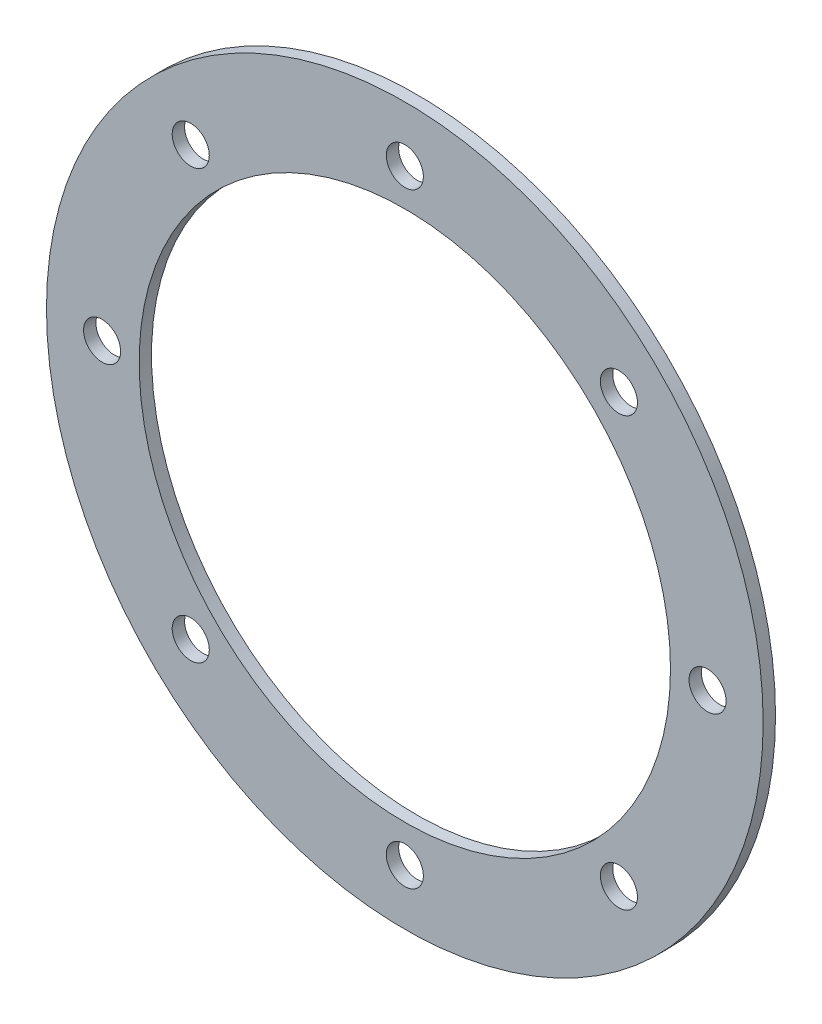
ISO-10303-21;
HEADER;
FILE_DESCRIPTION(('STEP AP214'),'2;1');
FILE_NAME('part.step','',(''),(''),'','','');
FILE_SCHEMA(('AUTOMOTIVE_DESIGN { 1 0 10303 214 1 1 1 1 }'));
ENDSEC;
DATA;
#1=APPLICATION_CONTEXT('core data for automotive mechanical design processes');
#2=APPLICATION_PROTOCOL_DEFINITION('international standard','automotive_design',2000,#1);
#3=PRODUCT_CONTEXT('',#1,'mechanical');
#4=PRODUCT('Part','Part','',(#3));
#5=PRODUCT_RELATED_PRODUCT_CATEGORY('part','',(#4));
#6=PRODUCT_DEFINITION_FORMATION('','',#4);
#7=PRODUCT_DEFINITION_CONTEXT('part definition',#1,'design');
#8=PRODUCT_DEFINITION('design','',#6,#7);
#9=PRODUCT_DEFINITION_SHAPE('','',#8);
#10=(LENGTH_UNIT() NAMED_UNIT(*) SI_UNIT(.MILLI.,.METRE.));
#11=(NAMED_UNIT(*) PLANE_ANGLE_UNIT() SI_UNIT($,.RADIAN.));
#12=(NAMED_UNIT(*) SI_UNIT($,.STERADIAN.) SOLID_ANGLE_UNIT());
#13=UNCERTAINTY_MEASURE_WITH_UNIT(LENGTH_MEASURE(1.E-05),#10,'distance_accuracy_value','');
#14=(GEOMETRIC_REPRESENTATION_CONTEXT(3) GLOBAL_UNCERTAINTY_ASSIGNED_CONTEXT((#13)) GLOBAL_UNIT_ASSIGNED_CONTEXT((#10,
#11,#12)) REPRESENTATION_CONTEXT('',''));
#15=CARTESIAN_POINT('',(0.,0.,0.));
#16=DIRECTION('',(0.,0.,1.));
#17=DIRECTION('',(1.,0.,0.));
#18=AXIS2_PLACEMENT_3D('',#15,#16,#17);
#19=CARTESIAN_POINT('',(-51.4982260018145,18.1475662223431,0.));
#20=DIRECTION('',(0.,0.,1.));
#21=DIRECTION('',(1.,0.,0.));
#22=AXIS2_PLACEMENT_3D('',#19,#20,#21);
#23=PLANE('',#22);
#24=CARTESIAN_POINT('',(-51.4982260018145,42.6475662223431,0.));
#25=DIRECTION('',(0.,0.,1.));
#26=DIRECTION('',(1.,0.,0.));
#27=AXIS2_PLACEMENT_3D('',#24,#25,#26);
#28=CIRCLE('',#27,1.5);
#29=CARTESIAN_POINT('',(-49.9982260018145,42.6475662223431,0.));
#30=VERTEX_POINT('',#29);
#31=EDGE_CURVE('E101',#30,#30,#28,.T.);
#32=ORIENTED_EDGE('',*,*,#31,.T.);
#33=EDGE_LOOP('',(#32));
#34=FACE_BOUND('',#33,.T.);
#35=CARTESIAN_POINT('',(-34.1741098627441,35.4716823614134,0.));
#36=DIRECTION('',(0.,0.,1.));
#37=DIRECTION('',(1.,0.,0.));
#38=AXIS2_PLACEMENT_3D('',#35,#36,#37);
#39=CIRCLE('',#38,1.49999999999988);
#40=CARTESIAN_POINT('',(-32.6741098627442,35.4716823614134,0.));
#41=VERTEX_POINT('',#40);
#42=EDGE_CURVE('E90',#41,#41,#39,.T.);
#43=ORIENTED_EDGE('',*,*,#42,.T.);
#44=EDGE_LOOP('',(#43));
#45=FACE_BOUND('',#44,.T.);
#46=CARTESIAN_POINT('',(-26.9982260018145,18.1475662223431,0.));
#47=DIRECTION('',(0.,0.,1.));
#48=DIRECTION('',(1.,0.,0.));
#49=AXIS2_PLACEMENT_3D('',#46,#47,#48);
#50=CIRCLE('',#49,1.49999999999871);
#51=CARTESIAN_POINT('',(-25.4982260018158,18.1475662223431,0.));
#52=VERTEX_POINT('',#51);
#53=EDGE_CURVE('E79',#52,#52,#50,.T.);
#54=ORIENTED_EDGE('',*,*,#53,.T.);
#55=EDGE_LOOP('',(#54));
#56=FACE_BOUND('',#55,.T.);
#57=CARTESIAN_POINT('',(-34.1741098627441,0.823450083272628,0.));
#58=DIRECTION('',(0.,0.,1.));
#59=DIRECTION('',(1.,0.,0.));
#60=AXIS2_PLACEMENT_3D('',#57,#58,#59);
#61=CIRCLE('',#60,1.49999999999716);
#62=CARTESIAN_POINT('',(-32.6741098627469,0.823450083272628,0.));
#63=VERTEX_POINT('',#62);
#64=EDGE_CURVE('E74',#63,#63,#61,.T.);
#65=ORIENTED_EDGE('',*,*,#64,.T.);
#66=EDGE_LOOP('',(#65));
#67=FACE_BOUND('',#66,.T.);
#68=CARTESIAN_POINT('',(-51.4982260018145,-6.35243377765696,0.));
#69=DIRECTION('',(0.,0.,1.));
#70=DIRECTION('',(1.,0.,0.));
#71=AXIS2_PLACEMENT_3D('',#68,#69,#70);
#72=CIRCLE('',#71,1.49999999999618);
#73=CARTESIAN_POINT('',(-49.9982260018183,-6.35243377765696,0.));
#74=VERTEX_POINT('',#73);
#75=EDGE_CURVE('E66',#74,#74,#72,.T.);
#76=ORIENTED_EDGE('',*,*,#75,.T.);
#77=EDGE_LOOP('',(#76));
#78=FACE_BOUND('',#77,.T.);
#79=CARTESIAN_POINT('',(-68.8223421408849,0.823450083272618,0.));
#80=DIRECTION('',(0.,0.,1.));
#81=DIRECTION('',(1.,0.,0.));
#82=AXIS2_PLACEMENT_3D('',#79,#80,#81);
#83=CIRCLE('',#82,1.49999999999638);
#84=CARTESIAN_POINT('',(-67.3223421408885,0.823450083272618,0.));
#85=VERTEX_POINT('',#84);
#86=EDGE_CURVE('E58',#85,#85,#83,.T.);
#87=ORIENTED_EDGE('',*,*,#86,.T.);
#88=EDGE_LOOP('',(#87));
#89=FACE_BOUND('',#88,.T.);
#90=CARTESIAN_POINT('',(-75.9982260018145,18.1475662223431,0.));
#91=DIRECTION('',(0.,0.,1.));
#92=DIRECTION('',(1.,0.,0.));
#93=AXIS2_PLACEMENT_3D('',#90,#91,#92);
#94=CIRCLE('',#93,1.49999999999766);
#95=CARTESIAN_POINT('',(-74.4982260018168,18.1475662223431,0.));
#96=VERTEX_POINT('',#95);
#97=EDGE_CURVE('E53',#96,#96,#94,.T.);
#98=ORIENTED_EDGE('',*,*,#97,.T.);
#99=EDGE_LOOP('',(#98));
#100=FACE_BOUND('',#99,.T.);
#101=CARTESIAN_POINT('',(-68.8223421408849,35.4716823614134,0.));
#102=DIRECTION('',(0.,0.,1.));
#103=DIRECTION('',(1.,0.,0.));
#104=AXIS2_PLACEMENT_3D('',#101,#102,#103);
#105=CIRCLE('',#104,1.49999999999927);
#106=CARTESIAN_POINT('',(-67.3223421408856,35.4716823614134,0.));
#107=VERTEX_POINT('',#106);
#108=EDGE_CURVE('E45',#107,#107,#105,.T.);
#109=ORIENTED_EDGE('',*,*,#108,.T.);
#110=EDGE_LOOP('',(#109));
#111=FACE_BOUND('',#110,.T.);
#112=CARTESIAN_POINT('',(-51.4982260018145,18.1475662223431,0.));
#113=DIRECTION('',(0.,0.,1.));
#114=DIRECTION('',(1.,0.,0.));
#115=AXIS2_PLACEMENT_3D('',#112,#113,#114);
#116=CIRCLE('',#115,21.5);
#117=CARTESIAN_POINT('',(-29.9982260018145,18.1475662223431,0.));
#118=VERTEX_POINT('',#117);
#119=EDGE_CURVE('E32',#118,#118,#116,.T.);
#120=ORIENTED_EDGE('',*,*,#119,.T.);
#121=EDGE_LOOP('',(#120));
#122=FACE_BOUND('',#121,.T.);
#123=CARTESIAN_POINT('',(-51.4982260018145,18.1475662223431,0.));
#124=DIRECTION('',(0.,0.,1.));
#125=DIRECTION('',(1.,0.,0.));
#126=AXIS2_PLACEMENT_3D('',#123,#124,#125);
#127=CIRCLE('',#126,29.);
#128=CARTESIAN_POINT('',(-22.4982260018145,18.1475662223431,0.));
#129=VERTEX_POINT('',#128);
#130=EDGE_CURVE('E10',#129,#129,#127,.T.);
#131=ORIENTED_EDGE('',*,*,#130,.F.);
#132=EDGE_LOOP('',(#131));
#133=FACE_BOUND('',#132,.T.);
#134=ADVANCED_FACE('F15',(#34,#45,#56,#67,#78,#89,#100,#111,#122,#133),#23,.F.);
#135=CARTESIAN_POINT('',(-51.4982260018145,18.1475662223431,1.));
#136=DIRECTION('',(0.,0.,1.));
#137=DIRECTION('',(1.,0.,0.));
#138=AXIS2_PLACEMENT_3D('',#135,#136,#137);
#139=PLANE('',#138);
#140=CARTESIAN_POINT('',(-51.4982260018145,42.6475662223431,1.));
#141=DIRECTION('',(0.,0.,1.));
#142=DIRECTION('',(1.,0.,0.));
#143=AXIS2_PLACEMENT_3D('',#140,#141,#142);
#144=CIRCLE('',#143,1.5);
#145=CARTESIAN_POINT('',(-49.9982260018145,42.6475662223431,1.));
#146=VERTEX_POINT('',#145);
#147=EDGE_CURVE('E102',#146,#146,#144,.T.);
#148=ORIENTED_EDGE('',*,*,#147,.F.);
#149=EDGE_LOOP('',(#148));
#150=FACE_BOUND('',#149,.T.);
#151=CARTESIAN_POINT('',(-26.9982260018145,18.1475662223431,1.));
#152=DIRECTION('',(0.,0.,1.));
#153=DIRECTION('',(1.,0.,0.));
#154=AXIS2_PLACEMENT_3D('',#151,#152,#153);
#155=CIRCLE('',#154,1.49999999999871);
#156=CARTESIAN_POINT('',(-25.4982260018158,18.1475662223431,1.));
#157=VERTEX_POINT('',#156);
#158=EDGE_CURVE('E83',#157,#157,#155,.T.);
#159=ORIENTED_EDGE('',*,*,#158,.F.);
#160=EDGE_LOOP('',(#159));
#161=FACE_BOUND('',#160,.T.);
#162=CARTESIAN_POINT('',(-51.4982260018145,-6.35243377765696,1.));
#163=DIRECTION('',(0.,0.,1.));
#164=DIRECTION('',(1.,0.,0.));
#165=AXIS2_PLACEMENT_3D('',#162,#163,#164);
#166=CIRCLE('',#165,1.49999999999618);
#167=CARTESIAN_POINT('',(-49.9982260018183,-6.35243377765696,1.));
#168=VERTEX_POINT('',#167);
#169=EDGE_CURVE('E69',#168,#168,#166,.T.);
#170=ORIENTED_EDGE('',*,*,#169,.F.);
#171=EDGE_LOOP('',(#170));
#172=FACE_BOUND('',#171,.T.);
#173=CARTESIAN_POINT('',(-75.9982260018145,18.1475662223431,1.));
#174=DIRECTION('',(0.,0.,1.));
#175=DIRECTION('',(1.,0.,0.));
#176=AXIS2_PLACEMENT_3D('',#173,#174,#175);
#177=CIRCLE('',#176,1.49999999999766);
#178=CARTESIAN_POINT('',(-74.4982260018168,18.1475662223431,1.));
#179=VERTEX_POINT('',#178);
#180=EDGE_CURVE('E57',#179,#179,#177,.T.);
#181=ORIENTED_EDGE('',*,*,#180,.F.);
#182=EDGE_LOOP('',(#181));
#183=FACE_BOUND('',#182,.T.);
#184=CARTESIAN_POINT('',(-51.4982260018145,18.1475662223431,1.));
#185=DIRECTION('',(0.,0.,1.));
#186=DIRECTION('',(1.,0.,0.));
#187=AXIS2_PLACEMENT_3D('',#184,#185,#186);
#188=CIRCLE('',#187,21.5);
#189=CARTESIAN_POINT('',(-29.9982260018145,18.1475662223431,1.));
#190=VERTEX_POINT('',#189);
#191=EDGE_CURVE('E39',#190,#190,#188,.T.);
#192=ORIENTED_EDGE('',*,*,#191,.F.);
#193=EDGE_LOOP('',(#192));
#194=FACE_BOUND('',#193,.T.);
#195=CARTESIAN_POINT('',(-68.8223421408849,35.4716823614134,1.));
#196=DIRECTION('',(0.,0.,1.));
#197=DIRECTION('',(1.,0.,0.));
#198=AXIS2_PLACEMENT_3D('',#195,#196,#197);
#199=CIRCLE('',#198,1.49999999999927);
#200=CARTESIAN_POINT('',(-67.3223421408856,35.4716823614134,1.));
#201=VERTEX_POINT('',#200);
#202=EDGE_CURVE('E49',#201,#201,#199,.T.);
#203=ORIENTED_EDGE('',*,*,#202,.F.);
#204=EDGE_LOOP('',(#203));
#205=FACE_BOUND('',#204,.T.);
#206=CARTESIAN_POINT('',(-68.8223421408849,0.823450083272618,1.));
#207=DIRECTION('',(0.,0.,1.));
#208=DIRECTION('',(1.,0.,0.));
#209=AXIS2_PLACEMENT_3D('',#206,#207,#208);
#210=CIRCLE('',#209,1.49999999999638);
#211=CARTESIAN_POINT('',(-67.3223421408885,0.823450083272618,1.));
#212=VERTEX_POINT('',#211);
#213=EDGE_CURVE('E62',#212,#212,#210,.T.);
#214=ORIENTED_EDGE('',*,*,#213,.F.);
#215=EDGE_LOOP('',(#214));
#216=FACE_BOUND('',#215,.T.);
#217=CARTESIAN_POINT('',(-34.1741098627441,0.823450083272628,1.));
#218=DIRECTION('',(0.,0.,1.));
#219=DIRECTION('',(1.,0.,0.));
#220=AXIS2_PLACEMENT_3D('',#217,#218,#219);
#221=CIRCLE('',#220,1.49999999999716);
#222=CARTESIAN_POINT('',(-32.6741098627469,0.823450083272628,1.));
#223=VERTEX_POINT('',#222);
#224=EDGE_CURVE('E78',#223,#223,#221,.T.);
#225=ORIENTED_EDGE('',*,*,#224,.F.);
#226=EDGE_LOOP('',(#225));
#227=FACE_BOUND('',#226,.T.);
#228=CARTESIAN_POINT('',(-34.1741098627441,35.4716823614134,1.));
#229=DIRECTION('',(0.,0.,1.));
#230=DIRECTION('',(1.,0.,0.));
#231=AXIS2_PLACEMENT_3D('',#228,#229,#230);
#232=CIRCLE('',#231,1.49999999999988);
#233=CARTESIAN_POINT('',(-32.6741098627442,35.4716823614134,1.));
#234=VERTEX_POINT('',#233);
#235=EDGE_CURVE('E94',#234,#234,#232,.T.);
#236=ORIENTED_EDGE('',*,*,#235,.F.);
#237=EDGE_LOOP('',(#236));
#238=FACE_BOUND('',#237,.T.);
#239=CARTESIAN_POINT('',(-51.4982260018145,18.1475662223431,1.));
#240=DIRECTION('',(0.,0.,1.));
#241=DIRECTION('',(1.,0.,0.));
#242=AXIS2_PLACEMENT_3D('',#239,#240,#241);
#243=CIRCLE('',#242,29.);
#244=CARTESIAN_POINT('',(-22.4982260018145,18.1475662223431,1.));
#245=VERTEX_POINT('',#244);
#246=EDGE_CURVE('E23',#245,#245,#243,.T.);
#247=ORIENTED_EDGE('',*,*,#246,.T.);
#248=EDGE_LOOP('',(#247));
#249=FACE_BOUND('',#248,.T.);
#250=ADVANCED_FACE('F121',(#150,#161,#172,#183,#194,#205,#216,#227,#238,#249),#139,.T.);
#251=CARTESIAN_POINT('',(-51.4982260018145,18.1475662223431,1.));
#252=DIRECTION('',(0.,0.,-1.));
#253=DIRECTION('',(-1.,0.,0.));
#254=AXIS2_PLACEMENT_3D('',#251,#252,#253);
#255=CYLINDRICAL_SURFACE('',#254,29.);
#256=ORIENTED_EDGE('',*,*,#130,.T.);
#257=EDGE_LOOP('',(#256));
#258=FACE_BOUND('',#257,.T.);
#259=ORIENTED_EDGE('',*,*,#246,.F.);
#260=EDGE_LOOP('',(#259));
#261=FACE_BOUND('',#260,.T.);
#262=ADVANCED_FACE('F124',(#258,#261),#255,.T.);
#263=CARTESIAN_POINT('',(-51.4982260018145,18.1475662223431,1.));
#264=DIRECTION('',(0.,0.,-1.));
#265=DIRECTION('',(-1.,0.,0.));
#266=AXIS2_PLACEMENT_3D('',#263,#264,#265);
#267=CYLINDRICAL_SURFACE('',#266,21.5);
#268=ORIENTED_EDGE('',*,*,#119,.F.);
#269=EDGE_LOOP('',(#268));
#270=FACE_BOUND('',#269,.T.);
#271=ORIENTED_EDGE('',*,*,#191,.T.);
#272=EDGE_LOOP('',(#271));
#273=FACE_BOUND('',#272,.T.);
#274=ADVANCED_FACE('F17',(#270,#273),#267,.F.);
#275=CARTESIAN_POINT('',(-68.8223421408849,35.4716823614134,1.));
#276=DIRECTION('',(0.,0.,-1.));
#277=DIRECTION('',(-1.,0.,0.));
#278=AXIS2_PLACEMENT_3D('',#275,#276,#277);
#279=CYLINDRICAL_SURFACE('',#278,1.49999999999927);
#280=ORIENTED_EDGE('',*,*,#108,.F.);
#281=EDGE_LOOP('',(#280));
#282=FACE_BOUND('',#281,.T.);
#283=ORIENTED_EDGE('',*,*,#202,.T.);
#284=EDGE_LOOP('',(#283));
#285=FACE_BOUND('',#284,.T.);
#286=ADVANCED_FACE('F188',(#282,#285),#279,.F.);
#287=CARTESIAN_POINT('',(-75.9982260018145,18.1475662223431,1.));
#288=DIRECTION('',(0.,0.,-1.));
#289=DIRECTION('',(-1.,0.,0.));
#290=AXIS2_PLACEMENT_3D('',#287,#288,#289);
#291=CYLINDRICAL_SURFACE('',#290,1.49999999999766);
#292=ORIENTED_EDGE('',*,*,#97,.F.);
#293=EDGE_LOOP('',(#292));
#294=FACE_BOUND('',#293,.T.);
#295=ORIENTED_EDGE('',*,*,#180,.T.);
#296=EDGE_LOOP('',(#295));
#297=FACE_BOUND('',#296,.T.);
#298=ADVANCED_FACE('F170',(#294,#297),#291,.F.);
#299=CARTESIAN_POINT('',(-68.8223421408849,0.823450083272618,1.));
#300=DIRECTION('',(0.,0.,-1.));
#301=DIRECTION('',(-1.,0.,0.));
#302=AXIS2_PLACEMENT_3D('',#299,#300,#301);
#303=CYLINDRICAL_SURFACE('',#302,1.49999999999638);
#304=ORIENTED_EDGE('',*,*,#86,.F.);
#305=EDGE_LOOP('',(#304));
#306=FACE_BOUND('',#305,.T.);
#307=ORIENTED_EDGE('',*,*,#213,.T.);
#308=EDGE_LOOP('',(#307));
#309=FACE_BOUND('',#308,.T.);
#310=ADVANCED_FACE('F162',(#306,#309),#303,.F.);
#311=CARTESIAN_POINT('',(-51.4982260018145,-6.35243377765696,1.));
#312=DIRECTION('',(0.,0.,-1.));
#313=DIRECTION('',(-1.,0.,0.));
#314=AXIS2_PLACEMENT_3D('',#311,#312,#313);
#315=CYLINDRICAL_SURFACE('',#314,1.49999999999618);
#316=ORIENTED_EDGE('',*,*,#75,.F.);
#317=EDGE_LOOP('',(#316));
#318=FACE_BOUND('',#317,.T.);
#319=ORIENTED_EDGE('',*,*,#169,.T.);
#320=EDGE_LOOP('',(#319));
#321=FACE_BOUND('',#320,.T.);
#322=ADVANCED_FACE('F160',(#318,#321),#315,.F.);
#323=CARTESIAN_POINT('',(-34.1741098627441,0.823450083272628,1.));
#324=DIRECTION('',(0.,0.,-1.));
#325=DIRECTION('',(-1.,0.,0.));
#326=AXIS2_PLACEMENT_3D('',#323,#324,#325);
#327=CYLINDRICAL_SURFACE('',#326,1.49999999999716);
#328=ORIENTED_EDGE('',*,*,#64,.F.);
#329=EDGE_LOOP('',(#328));
#330=FACE_BOUND('',#329,.T.);
#331=ORIENTED_EDGE('',*,*,#224,.T.);
#332=EDGE_LOOP('',(#331));
#333=FACE_BOUND('',#332,.T.);
#334=ADVANCED_FACE('F150',(#330,#333),#327,.F.);
#335=CARTESIAN_POINT('',(-26.9982260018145,18.1475662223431,1.));
#336=DIRECTION('',(0.,0.,-1.));
#337=DIRECTION('',(-1.,0.,0.));
#338=AXIS2_PLACEMENT_3D('',#335,#336,#337);
#339=CYLINDRICAL_SURFACE('',#338,1.49999999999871);
#340=ORIENTED_EDGE('',*,*,#53,.F.);
#341=EDGE_LOOP('',(#340));
#342=FACE_BOUND('',#341,.T.);
#343=ORIENTED_EDGE('',*,*,#158,.T.);
#344=EDGE_LOOP('',(#343));
#345=FACE_BOUND('',#344,.T.);
#346=ADVANCED_FACE('F143',(#342,#345),#339,.F.);
#347=CARTESIAN_POINT('',(-34.1741098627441,35.4716823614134,1.));
#348=DIRECTION('',(0.,0.,-1.));
#349=DIRECTION('',(-1.,0.,0.));
#350=AXIS2_PLACEMENT_3D('',#347,#348,#349);
#351=CYLINDRICAL_SURFACE('',#350,1.49999999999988);
#352=ORIENTED_EDGE('',*,*,#42,.F.);
#353=EDGE_LOOP('',(#352));
#354=FACE_BOUND('',#353,.T.);
#355=ORIENTED_EDGE('',*,*,#235,.T.);
#356=EDGE_LOOP('',(#355));
#357=FACE_BOUND('',#356,.T.);
#358=ADVANCED_FACE('F117',(#354,#357),#351,.F.);
#359=CARTESIAN_POINT('',(-51.4982260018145,42.6475662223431,1.));
#360=DIRECTION('',(0.,0.,-1.));
#361=DIRECTION('',(-1.,0.,0.));
#362=AXIS2_PLACEMENT_3D('',#359,#360,#361);
#363=CYLINDRICAL_SURFACE('',#362,1.5);
#364=ORIENTED_EDGE('',*,*,#31,.F.);
#365=EDGE_LOOP('',(#364));
#366=FACE_BOUND('',#365,.T.);
#367=ORIENTED_EDGE('',*,*,#147,.T.);
#368=EDGE_LOOP('',(#367));
#369=FACE_BOUND('',#368,.T.);
#370=ADVANCED_FACE('F114',(#366,#369),#363,.F.);
#371=CLOSED_SHELL('',(#134,#250,#262,#274,#286,#298,#310,#322,#334,#346,#358,#370));
#372=MANIFOLD_SOLID_BREP('B1',#371);
#373=ADVANCED_BREP_SHAPE_REPRESENTATION('',(#18,#372),#14);
#374=SHAPE_DEFINITION_REPRESENTATION(#9,#373);
ENDSEC;
END-ISO-10303-21;
